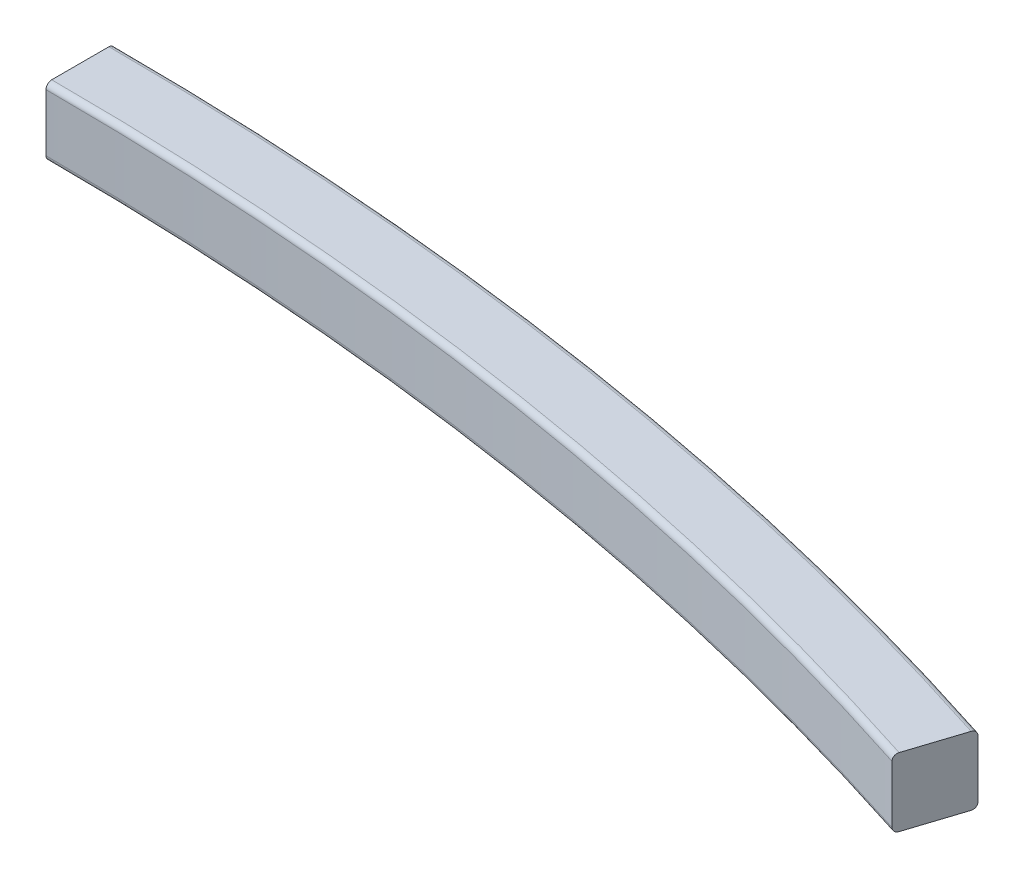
ISO-10303-21;
HEADER;
FILE_DESCRIPTION(('STEP AP214'),'2;1');
FILE_NAME('part.step','',(''),(''),'','','');
FILE_SCHEMA(('AUTOMOTIVE_DESIGN { 1 0 10303 214 1 1 1 1 }'));
ENDSEC;
DATA;
#1=APPLICATION_CONTEXT('core data for automotive mechanical design processes');
#2=APPLICATION_PROTOCOL_DEFINITION('international standard','automotive_design',2000,#1);
#3=PRODUCT_CONTEXT('',#1,'mechanical');
#4=PRODUCT('Part','Part','',(#3));
#5=PRODUCT_RELATED_PRODUCT_CATEGORY('part','',(#4));
#6=PRODUCT_DEFINITION_FORMATION('','',#4);
#7=PRODUCT_DEFINITION_CONTEXT('part definition',#1,'design');
#8=PRODUCT_DEFINITION('design','',#6,#7);
#9=PRODUCT_DEFINITION_SHAPE('','',#8);
#10=(LENGTH_UNIT() NAMED_UNIT(*) SI_UNIT(.MILLI.,.METRE.));
#11=(NAMED_UNIT(*) PLANE_ANGLE_UNIT() SI_UNIT($,.RADIAN.));
#12=(NAMED_UNIT(*) SI_UNIT($,.STERADIAN.) SOLID_ANGLE_UNIT());
#13=UNCERTAINTY_MEASURE_WITH_UNIT(LENGTH_MEASURE(1.E-05),#10,'distance_accuracy_value','');
#14=(GEOMETRIC_REPRESENTATION_CONTEXT(3) GLOBAL_UNCERTAINTY_ASSIGNED_CONTEXT((#13)) GLOBAL_UNIT_ASSIGNED_CONTEXT((#10,
#11,#12)) REPRESENTATION_CONTEXT('',''));
#15=CARTESIAN_POINT('',(0.,0.,0.));
#16=DIRECTION('',(0.,0.,1.));
#17=DIRECTION('',(1.,0.,0.));
#18=AXIS2_PLACEMENT_3D('',#15,#16,#17);
#19=CARTESIAN_POINT('',(0.,5.07999999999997,3000.));
#20=DIRECTION('',(0.,1.,0.));
#21=DIRECTION('',(0.,0.,1.));
#22=AXIS2_PLACEMENT_3D('',#19,#20,#21);
#23=TOROIDAL_SURFACE('',#22,2973.965,5.08);
#24=CARTESIAN_POINT('',(0.,0.,3000.));
#25=DIRECTION('',(0.,1.,0.));
#26=DIRECTION('',(0.,0.,1.));
#27=AXIS2_PLACEMENT_3D('',#24,#25,#26);
#28=CIRCLE('',#27,2973.965);
#29=CARTESIAN_POINT('',(916.551228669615,0.,170.794870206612));
#30=VERTEX_POINT('',#29);
#31=CARTESIAN_POINT('',(0.,0.,26.035));
#32=VERTEX_POINT('',#31);
#33=EDGE_CURVE('E12',#30,#32,#28,.T.);
#34=ORIENTED_EDGE('',*,*,#33,.F.);
#35=CARTESIAN_POINT('',(916.551228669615,5.07999999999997,170.794870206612));
#36=DIRECTION('',(0.951324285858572,0.,0.308191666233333));
#37=DIRECTION('',(0.308191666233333,0.,-0.951324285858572));
#38=AXIS2_PLACEMENT_3D('',#35,#36,#37);
#39=CIRCLE('',#38,5.08);
#40=CARTESIAN_POINT('',(914.98561500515,5.07999999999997,175.627597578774));
#41=VERTEX_POINT('',#40);
#42=EDGE_CURVE('E135',#41,#30,#39,.T.);
#43=ORIENTED_EDGE('',*,*,#42,.F.);
#44=CARTESIAN_POINT('',(0.,5.07999999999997,3000.));
#45=DIRECTION('',(0.,1.,0.));
#46=DIRECTION('',(0.,0.,1.));
#47=AXIS2_PLACEMENT_3D('',#44,#45,#46);
#48=CIRCLE('',#47,2968.885);
#49=CARTESIAN_POINT('',(0.,5.07999999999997,31.115));
#50=VERTEX_POINT('',#49);
#51=EDGE_CURVE('E51',#41,#50,#48,.T.);
#52=ORIENTED_EDGE('',*,*,#51,.T.);
#53=CARTESIAN_POINT('',(0.,5.07999999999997,26.0349999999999));
#54=DIRECTION('',(1.,0.,0.));
#55=DIRECTION('',(0.,0.,-1.));
#56=AXIS2_PLACEMENT_3D('',#53,#54,#55);
#57=CIRCLE('',#56,5.08);
#58=EDGE_CURVE('E111',#50,#32,#57,.T.);
#59=ORIENTED_EDGE('',*,*,#58,.T.);
#60=EDGE_LOOP('',(#34,#43,#52,#59));
#61=FACE_BOUND('',#60,.T.);
#62=ADVANCED_FACE('F36',(#61),#23,.T.);
#63=CARTESIAN_POINT('',(916.551228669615,0.,170.794870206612));
#64=DIRECTION('',(0.,1.,0.));
#65=DIRECTION('',(0.,0.,1.));
#66=AXIS2_PLACEMENT_3D('',#63,#64,#65);
#67=PLANE('',#66);
#68=CARTESIAN_POINT('',(0.,0.,3000.));
#69=DIRECTION('',(0.,1.,0.));
#70=DIRECTION('',(0.,0.,1.));
#71=AXIS2_PLACEMENT_3D('',#68,#69,#70);
#72=CIRCLE('',#71,3026.035);
#73=CARTESIAN_POINT('',(932.598768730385,0.,121.259414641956));
#74=VERTEX_POINT('',#73);
#75=CARTESIAN_POINT('',(0.,0.,-26.035));
#76=VERTEX_POINT('',#75);
#77=EDGE_CURVE('E44',#74,#76,#72,.T.);
#78=ORIENTED_EDGE('',*,*,#77,.F.);
#79=DIRECTION('',(0.308191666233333,0.,-0.951324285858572));
#80=VECTOR('',#79,1.);
#81=CARTESIAN_POINT('',(916.551228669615,0.,170.794870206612));
#82=LINE('',#81,#80);
#83=EDGE_CURVE('E107',#30,#74,#82,.T.);
#84=ORIENTED_EDGE('',*,*,#83,.F.);
#85=ORIENTED_EDGE('',*,*,#33,.T.);
#86=DIRECTION('',(0.,0.,-1.));
#87=VECTOR('',#86,1.);
#88=CARTESIAN_POINT('',(0.,0.,26.035));
#89=LINE('',#88,#87);
#90=EDGE_CURVE('E104',#32,#76,#89,.T.);
#91=ORIENTED_EDGE('',*,*,#90,.T.);
#92=EDGE_LOOP('',(#78,#84,#85,#91));
#93=FACE_BOUND('',#92,.T.);
#94=ADVANCED_FACE('F38',(#93),#67,.F.);
#95=CARTESIAN_POINT('',(0.,5.07999999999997,3000.));
#96=DIRECTION('',(0.,1.,0.));
#97=DIRECTION('',(0.,0.,1.));
#98=AXIS2_PLACEMENT_3D('',#95,#96,#97);
#99=TOROIDAL_SURFACE('',#98,3026.035,5.07999999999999);
#100=CARTESIAN_POINT('',(0.,5.08,3000.));
#101=DIRECTION('',(0.,1.,0.));
#102=DIRECTION('',(0.,0.,1.));
#103=AXIS2_PLACEMENT_3D('',#100,#101,#102);
#104=CIRCLE('',#103,3031.115);
#105=CARTESIAN_POINT('',(934.16438239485,5.08,116.426687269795));
#106=VERTEX_POINT('',#105);
#107=CARTESIAN_POINT('',(0.,5.08,-31.115));
#108=VERTEX_POINT('',#107);
#109=EDGE_CURVE('E163',#106,#108,#104,.T.);
#110=ORIENTED_EDGE('',*,*,#109,.F.);
#111=CARTESIAN_POINT('',(932.598768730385,5.07999999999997,121.259414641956));
#112=DIRECTION('',(0.951324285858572,0.,0.308191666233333));
#113=DIRECTION('',(-0.308191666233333,0.,0.951324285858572));
#114=AXIS2_PLACEMENT_3D('',#111,#112,#113);
#115=CIRCLE('',#114,5.07999999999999);
#116=EDGE_CURVE('E138',#74,#106,#115,.T.);
#117=ORIENTED_EDGE('',*,*,#116,.F.);
#118=ORIENTED_EDGE('',*,*,#77,.T.);
#119=CARTESIAN_POINT('',(0.,5.07999999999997,-26.035));
#120=DIRECTION('',(1.,0.,0.));
#121=DIRECTION('',(0.,0.,1.));
#122=AXIS2_PLACEMENT_3D('',#119,#120,#121);
#123=CIRCLE('',#122,5.07999999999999);
#124=EDGE_CURVE('E118',#76,#108,#123,.T.);
#125=ORIENTED_EDGE('',*,*,#124,.T.);
#126=EDGE_LOOP('',(#110,#117,#118,#125));
#127=FACE_BOUND('',#126,.T.);
#128=ADVANCED_FACE('F166',(#127),#99,.T.);
#129=CARTESIAN_POINT('',(0.,0.,3000.));
#130=DIRECTION('',(0.,1.,0.));
#131=DIRECTION('',(0.,0.,1.));
#132=AXIS2_PLACEMENT_3D('',#129,#130,#131);
#133=CYLINDRICAL_SURFACE('',#132,3031.115);
#134=CARTESIAN_POINT('',(0.,57.4039999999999,3000.));
#135=DIRECTION('',(0.,1.,0.));
#136=DIRECTION('',(0.,0.,1.));
#137=AXIS2_PLACEMENT_3D('',#134,#135,#136);
#138=CIRCLE('',#137,3031.115);
#139=CARTESIAN_POINT('',(934.16438239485,57.4039999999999,116.426687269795));
#140=VERTEX_POINT('',#139);
#141=CARTESIAN_POINT('',(0.,57.4039999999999,-31.115));
#142=VERTEX_POINT('',#141);
#143=EDGE_CURVE('E161',#140,#142,#138,.T.);
#144=ORIENTED_EDGE('',*,*,#143,.F.);
#145=DIRECTION('',(0.,1.,0.));
#146=VECTOR('',#145,1.);
#147=CARTESIAN_POINT('',(934.16438239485,5.08,116.426687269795));
#148=LINE('',#147,#146);
#149=EDGE_CURVE('E141',#106,#140,#148,.T.);
#150=ORIENTED_EDGE('',*,*,#149,.F.);
#151=ORIENTED_EDGE('',*,*,#109,.T.);
#152=DIRECTION('',(0.,1.,0.));
#153=VECTOR('',#152,1.);
#154=CARTESIAN_POINT('',(0.,5.08,-31.115));
#155=LINE('',#154,#153);
#156=EDGE_CURVE('E120',#108,#142,#155,.T.);
#157=ORIENTED_EDGE('',*,*,#156,.T.);
#158=EDGE_LOOP('',(#144,#150,#151,#157));
#159=FACE_BOUND('',#158,.T.);
#160=ADVANCED_FACE('F182',(#159),#133,.T.);
#161=CARTESIAN_POINT('',(0.,57.4039999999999,3000.));
#162=DIRECTION('',(0.,1.,0.));
#163=DIRECTION('',(0.,0.,1.));
#164=AXIS2_PLACEMENT_3D('',#161,#162,#163);
#165=TOROIDAL_SURFACE('',#164,3026.162,4.95300000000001);
#166=CARTESIAN_POINT('',(0.,62.3569999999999,3000.));
#167=DIRECTION('',(0.,1.,0.));
#168=DIRECTION('',(0.,0.,1.));
#169=AXIS2_PLACEMENT_3D('',#166,#167,#168);
#170=CIRCLE('',#169,3026.162);
#171=CARTESIAN_POINT('',(932.637909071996,62.3569999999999,121.138596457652));
#172=VERTEX_POINT('',#171);
#173=CARTESIAN_POINT('',(0.,62.3569999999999,-26.1619999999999));
#174=VERTEX_POINT('',#173);
#175=EDGE_CURVE('E159',#172,#174,#170,.T.);
#176=ORIENTED_EDGE('',*,*,#175,.F.);
#177=CARTESIAN_POINT('',(932.637909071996,57.4039999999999,121.138596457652));
#178=DIRECTION('',(0.951324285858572,0.,0.308191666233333));
#179=DIRECTION('',(-0.308191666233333,0.,0.951324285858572));
#180=AXIS2_PLACEMENT_3D('',#177,#178,#179);
#181=CIRCLE('',#180,4.95300000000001);
#182=EDGE_CURVE('E144',#140,#172,#181,.T.);
#183=ORIENTED_EDGE('',*,*,#182,.F.);
#184=ORIENTED_EDGE('',*,*,#143,.T.);
#185=CARTESIAN_POINT('',(0.,57.4039999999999,-26.1619999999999));
#186=DIRECTION('',(1.,0.,0.));
#187=DIRECTION('',(0.,0.,1.));
#188=AXIS2_PLACEMENT_3D('',#185,#186,#187);
#189=CIRCLE('',#188,4.95300000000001);
#190=EDGE_CURVE('E125',#142,#174,#189,.T.);
#191=ORIENTED_EDGE('',*,*,#190,.T.);
#192=EDGE_LOOP('',(#176,#183,#184,#191));
#193=FACE_BOUND('',#192,.T.);
#194=ADVANCED_FACE('F180',(#193),#165,.T.);
#195=CARTESIAN_POINT('',(916.590369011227,62.3569999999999,170.674052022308));
#196=DIRECTION('',(0.,-1.,0.));
#197=DIRECTION('',(0.,0.,-1.));
#198=AXIS2_PLACEMENT_3D('',#195,#196,#197);
#199=PLANE('',#198);
#200=CARTESIAN_POINT('',(0.,62.3569999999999,3000.));
#201=DIRECTION('',(0.,1.,0.));
#202=DIRECTION('',(0.,0.,1.));
#203=AXIS2_PLACEMENT_3D('',#200,#201,#202);
#204=CIRCLE('',#203,2974.092);
#205=CARTESIAN_POINT('',(916.590369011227,62.3569999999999,170.674052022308));
#206=VERTEX_POINT('',#205);
#207=CARTESIAN_POINT('',(0.,62.3569999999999,25.908));
#208=VERTEX_POINT('',#207);
#209=EDGE_CURVE('E157',#206,#208,#204,.T.);
#210=ORIENTED_EDGE('',*,*,#209,.F.);
#211=DIRECTION('',(-0.308191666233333,0.,0.951324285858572));
#212=VECTOR('',#211,1.);
#213=CARTESIAN_POINT('',(916.590369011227,62.3569999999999,170.674052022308));
#214=LINE('',#213,#212);
#215=EDGE_CURVE('E147',#172,#206,#214,.T.);
#216=ORIENTED_EDGE('',*,*,#215,.F.);
#217=ORIENTED_EDGE('',*,*,#175,.T.);
#218=DIRECTION('',(0.,0.,1.));
#219=VECTOR('',#218,1.);
#220=CARTESIAN_POINT('',(0.,62.3569999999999,25.908));
#221=LINE('',#220,#219);
#222=EDGE_CURVE('E128',#174,#208,#221,.T.);
#223=ORIENTED_EDGE('',*,*,#222,.T.);
#224=EDGE_LOOP('',(#210,#216,#217,#223));
#225=FACE_BOUND('',#224,.T.);
#226=ADVANCED_FACE('F176',(#225),#199,.F.);
#227=CARTESIAN_POINT('',(0.,57.1499999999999,3000.));
#228=DIRECTION('',(0.,1.,0.));
#229=DIRECTION('',(0.,0.,1.));
#230=AXIS2_PLACEMENT_3D('',#227,#228,#229);
#231=TOROIDAL_SURFACE('',#230,2974.092,5.207);
#232=CARTESIAN_POINT('',(0.,57.1499999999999,3000.));
#233=DIRECTION('',(0.,1.,0.));
#234=DIRECTION('',(0.,0.,1.));
#235=AXIS2_PLACEMENT_3D('',#232,#233,#234);
#236=CIRCLE('',#235,2968.885);
#237=CARTESIAN_POINT('',(914.98561500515,57.1499999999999,175.627597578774));
#238=VERTEX_POINT('',#237);
#239=CARTESIAN_POINT('',(0.,57.1499999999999,31.115));
#240=VERTEX_POINT('',#239);
#241=EDGE_CURVE('E59',#238,#240,#236,.T.);
#242=ORIENTED_EDGE('',*,*,#241,.F.);
#243=CARTESIAN_POINT('',(916.590369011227,57.1499999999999,170.674052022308));
#244=DIRECTION('',(0.951324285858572,0.,0.308191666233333));
#245=DIRECTION('',(0.308191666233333,0.,-0.951324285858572));
#246=AXIS2_PLACEMENT_3D('',#243,#244,#245);
#247=CIRCLE('',#246,5.207);
#248=EDGE_CURVE('E150',#206,#238,#247,.T.);
#249=ORIENTED_EDGE('',*,*,#248,.F.);
#250=ORIENTED_EDGE('',*,*,#209,.T.);
#251=CARTESIAN_POINT('',(0.,57.1499999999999,25.908));
#252=DIRECTION('',(1.,0.,0.));
#253=DIRECTION('',(0.,0.,-1.));
#254=AXIS2_PLACEMENT_3D('',#251,#252,#253);
#255=CIRCLE('',#254,5.207);
#256=EDGE_CURVE('E131',#208,#240,#255,.T.);
#257=ORIENTED_EDGE('',*,*,#256,.T.);
#258=EDGE_LOOP('',(#242,#249,#250,#257));
#259=FACE_BOUND('',#258,.T.);
#260=ADVANCED_FACE('F172',(#259),#231,.T.);
#261=CARTESIAN_POINT('',(0.,0.,3000.));
#262=DIRECTION('',(0.,1.,0.));
#263=DIRECTION('',(0.,0.,1.));
#264=AXIS2_PLACEMENT_3D('',#261,#262,#263);
#265=CYLINDRICAL_SURFACE('',#264,2968.885);
#266=DIRECTION('',(0.,-1.,0.));
#267=VECTOR('',#266,1.);
#268=CARTESIAN_POINT('',(914.98561500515,5.07999999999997,175.627597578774));
#269=LINE('',#268,#267);
#270=EDGE_CURVE('E152',#238,#41,#269,.T.);
#271=ORIENTED_EDGE('',*,*,#270,.F.);
#272=ORIENTED_EDGE('',*,*,#241,.T.);
#273=DIRECTION('',(0.,-1.,0.));
#274=VECTOR('',#273,1.);
#275=CARTESIAN_POINT('',(0.,5.07999999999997,31.115));
#276=LINE('',#275,#274);
#277=EDGE_CURVE('E133',#240,#50,#276,.T.);
#278=ORIENTED_EDGE('',*,*,#277,.T.);
#279=ORIENTED_EDGE('',*,*,#51,.F.);
#280=EDGE_LOOP('',(#271,#272,#278,#279));
#281=FACE_BOUND('',#280,.T.);
#282=ADVANCED_FACE('F170',(#281),#265,.F.);
#283=CARTESIAN_POINT('',(916.551228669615,5.07999999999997,170.794870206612));
#284=DIRECTION('',(0.951324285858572,0.,0.308191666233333));
#285=DIRECTION('',(0.308191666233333,0.,-0.951324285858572));
#286=AXIS2_PLACEMENT_3D('',#283,#284,#285);
#287=PLANE('',#286);
#288=ORIENTED_EDGE('',*,*,#42,.T.);
#289=ORIENTED_EDGE('',*,*,#83,.T.);
#290=ORIENTED_EDGE('',*,*,#116,.T.);
#291=ORIENTED_EDGE('',*,*,#149,.T.);
#292=ORIENTED_EDGE('',*,*,#182,.T.);
#293=ORIENTED_EDGE('',*,*,#215,.T.);
#294=ORIENTED_EDGE('',*,*,#248,.T.);
#295=ORIENTED_EDGE('',*,*,#270,.T.);
#296=EDGE_LOOP('',(#288,#289,#290,#291,#292,#293,#294,#295));
#297=FACE_BOUND('',#296,.T.);
#298=ADVANCED_FACE('F168',(#297),#287,.T.);
#299=CARTESIAN_POINT('',(0.,5.07999999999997,26.0349999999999));
#300=DIRECTION('',(1.,0.,0.));
#301=DIRECTION('',(0.,0.,-1.));
#302=AXIS2_PLACEMENT_3D('',#299,#300,#301);
#303=PLANE('',#302);
#304=ORIENTED_EDGE('',*,*,#58,.F.);
#305=ORIENTED_EDGE('',*,*,#277,.F.);
#306=ORIENTED_EDGE('',*,*,#256,.F.);
#307=ORIENTED_EDGE('',*,*,#222,.F.);
#308=ORIENTED_EDGE('',*,*,#190,.F.);
#309=ORIENTED_EDGE('',*,*,#156,.F.);
#310=ORIENTED_EDGE('',*,*,#124,.F.);
#311=ORIENTED_EDGE('',*,*,#90,.F.);
#312=EDGE_LOOP('',(#304,#305,#306,#307,#308,#309,#310,#311));
#313=FACE_BOUND('',#312,.T.);
#314=ADVANCED_FACE('F115',(#313),#303,.F.);
#315=CLOSED_SHELL('',(#62,#94,#128,#160,#194,#226,#260,#282,#298,#314));
#316=MANIFOLD_SOLID_BREP('B2',#315);
#317=ADVANCED_BREP_SHAPE_REPRESENTATION('',(#18,#316),#14);
#318=SHAPE_DEFINITION_REPRESENTATION(#9,#317);
ENDSEC;
END-ISO-10303-21;
